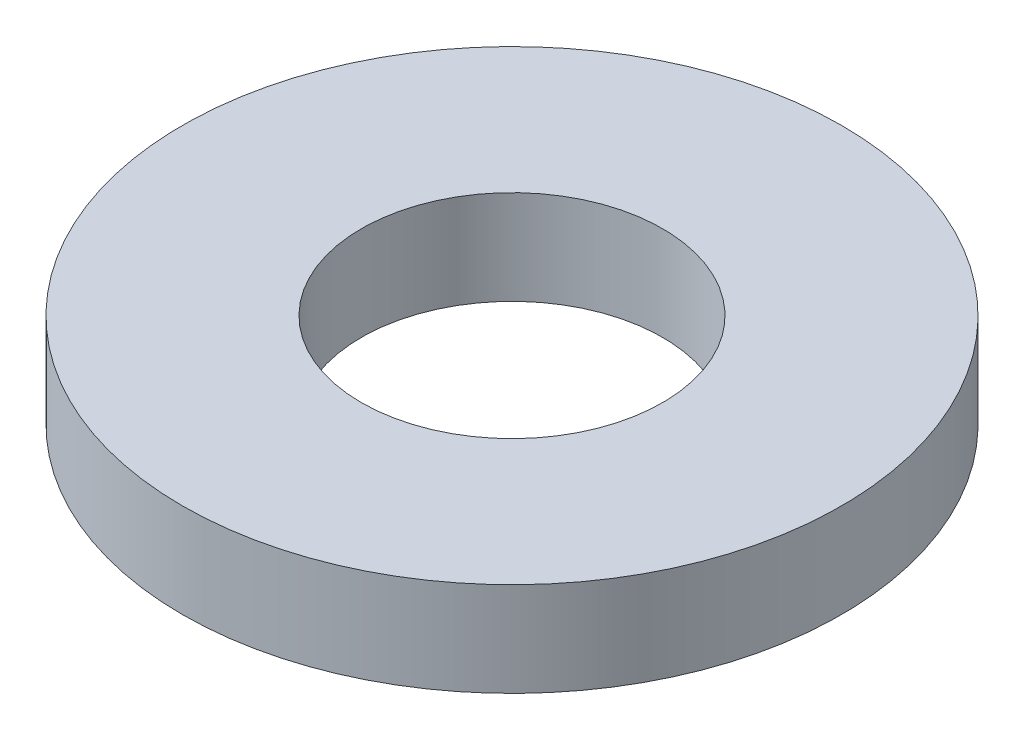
from build123d import *

# Parameters (mm, degrees)
SKETCH1_R      = 17.5
SKETCH1_R_2    = 8
EXTRUDE1_DEPTH = 5


with BuildPart() as part:
    # Sketch1 → Extrude1 (new body)
    with BuildSketch(Plane(origin=(0, 0, 0), x_dir=(1, 0, 0), z_dir=(0, 1, 0))):
        with Locations(Location((0, 0, 0), (0, 0, 270))):
            Circle(SKETCH1_R)
        with Locations(Location((0, 0, 0), (0, 0, 270))):
            Circle(SKETCH1_R_2, mode=Mode.SUBTRACT)
    extrude(amount=EXTRUDE1_DEPTH)


solid = part.part
